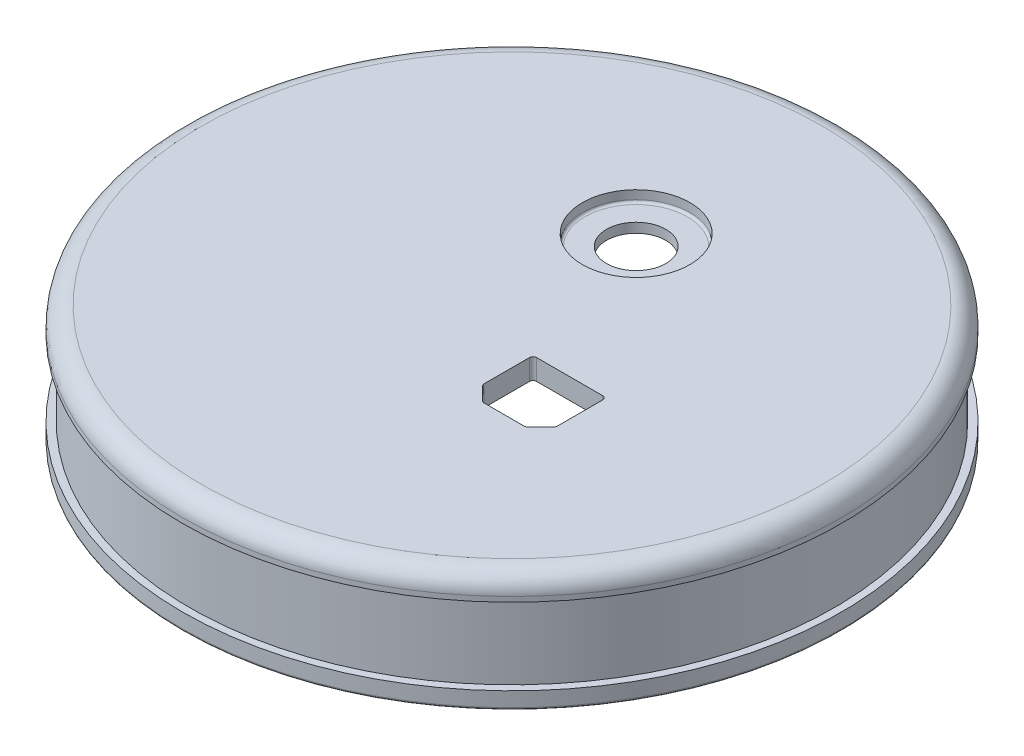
from build123d import *

# Parameters (mm, degrees)
SKETCH2_R          = 3.1115
CUT_EXTRUDE1_DEPTH = 0.762
CUT_EXTRUDE2_START = -1.159
SKETCH4_R          = 5.608
CUT_EXTRUDE2_DEPTH = 1.159
SKETCH5_R          = 3.0922
CUT_EXTRUDE3_DEPTH = 50.869213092
CUT_EXTRUDE4_DEPTH = 51.140812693
SKETCH7_R          = 31.61
SKETCH7_R_2        = 28.321
EXTRUDE1_DEPTH     = 1.7
FILLET1_R          = 0.381
FILLET2_R          = 0.508
CHAMFER1_SIZE      = 0.508
FILLET3_R          = 0.254
FILLET4_R          = 0.508


with BuildPart() as part:
    # Sketch1 → Revolve1 (revolve)
    with BuildSketch(Plane.XY, mode=Mode.PRIVATE) as revolve1_sk:
        with BuildLine():
            Line((31.61, -10.138654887), (31.61, 0))
            Line((31.61, 0), (0, 0))
            Line((0, 0), (0, 2.159))
            Line((0, 2.159), (32.372, 2.159))
            ThreePointArc((32.372, 2.159), (33.786213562, 1.573213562), (34.372, 0.159))
            Line((34.372, 0.159), (34.372, -0.360654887))
            Line((34.372, -0.360654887), (33.61, -0.360654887))
            Line((33.61, -0.360654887), (33.61, -8.360654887))
            Line((33.61, -8.360654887), (34.372, -8.360654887))
            Line((34.372, -8.360654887), (34.372, -10.138654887))
            Line((34.372, -10.138654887), (31.61, -10.138654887))
        make_face()
    revolve(revolve1_sk.sketch.rotate(Axis((0, -16.190658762, 0), (0, 1, 0)), 90), axis=Axis((0, -16.190658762, 0), (0, 1, 0)))

    # Sketch2 → Cut-Extrude1 (cut)
    with BuildSketch(Plane.XZ):
        with Locations(Location((0, 24.15, 0), (0, 0, 270))):
            Circle(SKETCH2_R)
    cut_extrude1 = extrude(amount=-CUT_EXTRUDE1_DEPTH, mode=Mode.SUBTRACT)

    # Mirror1: Cut-Extrude1 across plane
    add(cut_extrude1.mirror(Plane.XY), mode=Mode.SUBTRACT)

    # Sketch3 → Revolve2 (revolve)
    with BuildSketch(Plane.XY, mode=Mode.PRIVATE) as revolve2_sk:
        with BuildLine():
            Line((31.61, -3.979654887), (31.61, -4.741654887))
            ThreePointArc((31.61, -4.741654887), (31.229, -4.360654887), (31.61, -3.979654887))
        make_face()
    revolve(revolve2_sk.sketch.rotate(Axis((0, 0, 0), (0, -1, 0)), 270), axis=Axis((0, 0, 0), (0, -1, 0)))

    # Sketch4 → Cut-Extrude2 (cut)
    with BuildSketch(Plane(origin=(0, 2.159, 0), x_dir=(-1, 0, 0), z_dir=(0, 1, 0)).offset(CUT_EXTRUDE2_START)):
        with Locations(Location((0, -12.9492, 0), (0, 0, 90))):
            Circle(SKETCH4_R)
    extrude(amount=CUT_EXTRUDE2_DEPTH, mode=Mode.SUBTRACT)

    # Sketch5 → Cut-Extrude3 (cut, through all)
    with BuildSketch(Plane(origin=(0, 1, 0), x_dir=(-1, 0, 0), z_dir=(0, 1, 0))):
        with Locations(Location((0, -12.9492, 0), (0, 0, 90))):
            Circle(SKETCH5_R)
    extrude(amount=-CUT_EXTRUDE3_DEPTH, mode=Mode.SUBTRACT)

    # Sketch6 → Cut-Extrude4 (cut, through all)
    with BuildSketch(Plane(origin=(0, 2.159, 0), x_dir=(-1, 0, 0), z_dir=(0, 1, 0))):
        Polygon((-7.216168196, 10.2808), (-5.6352, 8.699831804), (-5.6352, 3.4372), (-13.2788, 3.4372), (-13.2788, 8.699831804), (-11.697831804, 10.2808), align=None)
    extrude(amount=-CUT_EXTRUDE4_DEPTH, mode=Mode.SUBTRACT)

    # Sketch7 → Extrude1 (add)
    with BuildSketch(Plane.XZ):
        with Locations(Location((0, 0, 0), (0, 0, 90))):
            Circle(SKETCH7_R)
        with Locations(Location((0, 0, 0), (0, 0, 90))):
            Circle(SKETCH7_R_2, mode=Mode.SUBTRACT)
    extrude(amount=EXTRUDE1_DEPTH)

    # Fillet1
    fillet1_edges = [part.edges().sort_by_distance(p)[0] for p in [
        (5.6352, 1.0795, 8.699831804),
        (5.6352, 1.0795, 3.4372),
        (13.2788, 1.0795, 3.4372),
        (13.2788, 1.0795, 8.699831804),
        (11.697831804, 1.0795, 10.2808),
        (7.216168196, 1.0795, 10.2808),
    ]]
    fillet(fillet1_edges, radius=FILLET1_R)

    # Fillet2
    fillet2_edges = [part.edges().sort_by_distance(p)[0] for p in [
        (0, 0, -28.321),
    ]]
    fillet(fillet2_edges, radius=FILLET2_R)

    # Chamfer1
    chamfer1_edges = [part.edges().sort_by_distance(p)[0] for p in [
        (0, -10.138654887, 31.61),
    ]]
    chamfer(chamfer1_edges, length=CHAMFER1_SIZE)

    # Fillet3
    fillet3_edges = [part.edges().sort_by_distance(p)[0] for p in [
        (0, -10.138654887, 34.372),
        (0, 1, -18.5572),
    ]]
    fillet(fillet3_edges, radius=FILLET3_R)

    # Fillet4
    fillet4_edges = [part.edges().sort_by_distance(p)[0] for p in [
        (0, 0.762, 27.2615),
        (0, 0.762, -27.2615),
    ]]
    fillet(fillet4_edges, radius=FILLET4_R)


solid = part.part
